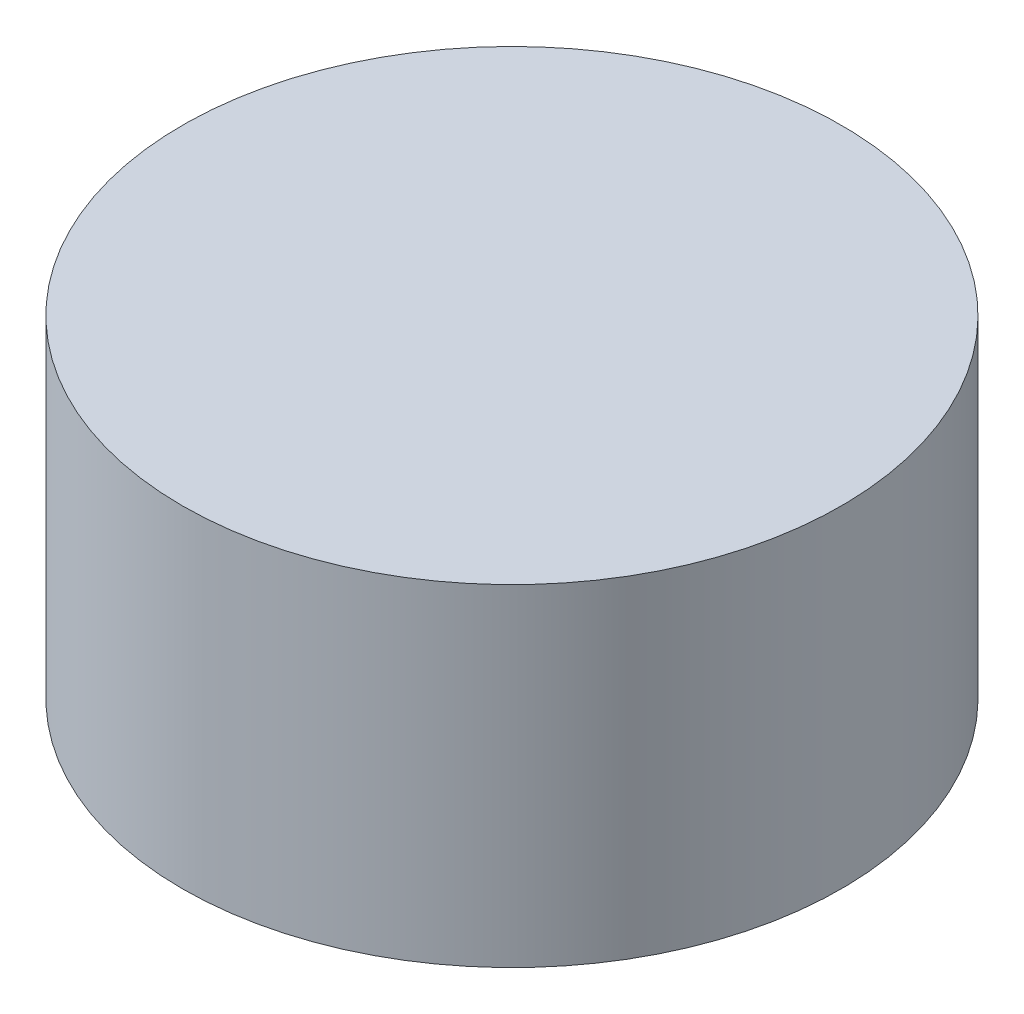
from build123d import *

# Parameters (mm, degrees)
SKETCH1_R           = 1.9939
BOSS_EXTRUDE1_DEPTH = 2.0066


with BuildPart() as part:
    # Sketch1 → Boss-Extrude1 (new body)
    with BuildSketch(Plane(origin=(0, 0, 0), x_dir=(1, 0, 0), z_dir=(0, 1, 0))):
        with Locations(Location((0, 0, 0), (0, 0, 270))):
            Circle(SKETCH1_R)
    extrude(amount=BOSS_EXTRUDE1_DEPTH)


solid = part.part
